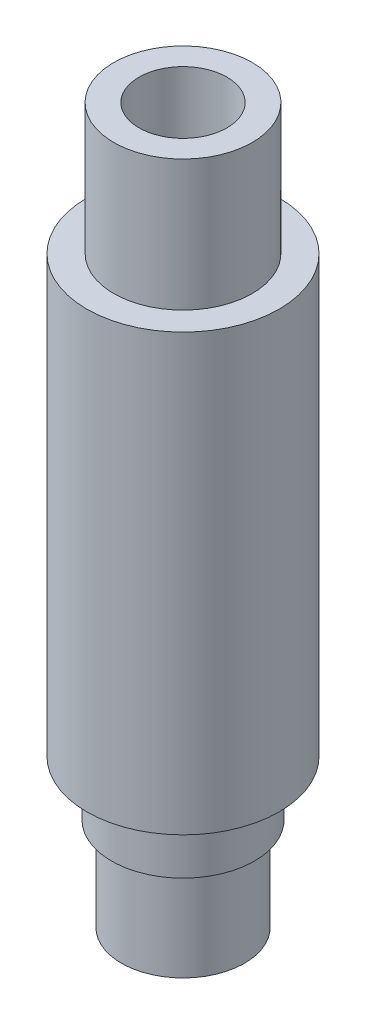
ISO-10303-21;
HEADER;
FILE_DESCRIPTION(('STEP AP214'),'2;1');
FILE_NAME('part.step','',(''),(''),'','','');
FILE_SCHEMA(('AUTOMOTIVE_DESIGN { 1 0 10303 214 1 1 1 1 }'));
ENDSEC;
DATA;
#1=APPLICATION_CONTEXT('core data for automotive mechanical design processes');
#2=APPLICATION_PROTOCOL_DEFINITION('international standard','automotive_design',2000,#1);
#3=PRODUCT_CONTEXT('',#1,'mechanical');
#4=PRODUCT('Part','Part','',(#3));
#5=PRODUCT_RELATED_PRODUCT_CATEGORY('part','',(#4));
#6=PRODUCT_DEFINITION_FORMATION('','',#4);
#7=PRODUCT_DEFINITION_CONTEXT('part definition',#1,'design');
#8=PRODUCT_DEFINITION('design','',#6,#7);
#9=PRODUCT_DEFINITION_SHAPE('','',#8);
#10=(LENGTH_UNIT() NAMED_UNIT(*) SI_UNIT(.MILLI.,.METRE.));
#11=(NAMED_UNIT(*) PLANE_ANGLE_UNIT() SI_UNIT($,.RADIAN.));
#12=(NAMED_UNIT(*) SI_UNIT($,.STERADIAN.) SOLID_ANGLE_UNIT());
#13=UNCERTAINTY_MEASURE_WITH_UNIT(LENGTH_MEASURE(1.E-05),#10,'distance_accuracy_value','');
#14=(GEOMETRIC_REPRESENTATION_CONTEXT(3) GLOBAL_UNCERTAINTY_ASSIGNED_CONTEXT((#13)) GLOBAL_UNIT_ASSIGNED_CONTEXT((#10,
#11,#12)) REPRESENTATION_CONTEXT('',''));
#15=CARTESIAN_POINT('',(0.,0.,0.));
#16=DIRECTION('',(0.,0.,1.));
#17=DIRECTION('',(1.,0.,0.));
#18=AXIS2_PLACEMENT_3D('',#15,#16,#17);
#19=CARTESIAN_POINT('',(0.,-5.95,0.));
#20=DIRECTION('',(0.,1.,0.));
#21=DIRECTION('',(0.,0.,1.));
#22=AXIS2_PLACEMENT_3D('',#19,#20,#21);
#23=CYLINDRICAL_SURFACE('',#22,2.);
#24=CARTESIAN_POINT('',(0.,0.,0.));
#25=DIRECTION('',(0.,-1.,0.));
#26=DIRECTION('',(0.,0.,-1.));
#27=AXIS2_PLACEMENT_3D('',#24,#25,#26);
#28=CIRCLE('',#27,2.);
#29=CARTESIAN_POINT('',(0.,0.,-2.));
#30=VERTEX_POINT('',#29);
#31=EDGE_CURVE('E10',#30,#30,#28,.T.);
#32=ORIENTED_EDGE('',*,*,#31,.F.);
#33=EDGE_LOOP('',(#32));
#34=FACE_BOUND('',#33,.T.);
#35=CARTESIAN_POINT('',(0.,-25.75,0.));
#36=DIRECTION('',(0.,-1.,0.));
#37=DIRECTION('',(0.,0.,-1.));
#38=AXIS2_PLACEMENT_3D('',#35,#36,#37);
#39=CIRCLE('',#38,2.);
#40=CARTESIAN_POINT('',(0.,-25.75,-2.));
#41=VERTEX_POINT('',#40);
#42=EDGE_CURVE('E23',#41,#41,#39,.T.);
#43=ORIENTED_EDGE('',*,*,#42,.T.);
#44=EDGE_LOOP('',(#43));
#45=FACE_BOUND('',#44,.T.);
#46=ADVANCED_FACE('F17',(#34,#45),#23,.F.);
#47=CARTESIAN_POINT('',(0.,-5.95,0.));
#48=DIRECTION('',(0.,1.,0.));
#49=DIRECTION('',(0.,0.,1.));
#50=AXIS2_PLACEMENT_3D('',#47,#48,#49);
#51=CYLINDRICAL_SURFACE('',#50,3.15);
#52=CARTESIAN_POINT('',(0.,-5.95,0.));
#53=DIRECTION('',(0.,-1.,0.));
#54=DIRECTION('',(0.,0.,-1.));
#55=AXIS2_PLACEMENT_3D('',#52,#53,#54);
#56=CIRCLE('',#55,3.15);
#57=CARTESIAN_POINT('',(0.,-5.95,-3.15));
#58=VERTEX_POINT('',#57);
#59=EDGE_CURVE('E27',#58,#58,#56,.T.);
#60=ORIENTED_EDGE('',*,*,#59,.F.);
#61=EDGE_LOOP('',(#60));
#62=FACE_BOUND('',#61,.T.);
#63=CARTESIAN_POINT('',(0.,0.,0.));
#64=DIRECTION('',(0.,-1.,0.));
#65=DIRECTION('',(0.,0.,-1.));
#66=AXIS2_PLACEMENT_3D('',#63,#64,#65);
#67=CIRCLE('',#66,3.15);
#68=CARTESIAN_POINT('',(0.,0.,-3.15));
#69=VERTEX_POINT('',#68);
#70=EDGE_CURVE('E31',#69,#69,#67,.T.);
#71=ORIENTED_EDGE('',*,*,#70,.T.);
#72=EDGE_LOOP('',(#71));
#73=FACE_BOUND('',#72,.T.);
#74=ADVANCED_FACE('F104',(#62,#73),#51,.T.);
#75=CARTESIAN_POINT('',(0.,0.,0.));
#76=DIRECTION('',(0.,-1.,0.));
#77=DIRECTION('',(1.,0.,0.));
#78=AXIS2_PLACEMENT_3D('',#75,#76,#77);
#79=PLANE('',#78);
#80=ORIENTED_EDGE('',*,*,#31,.T.);
#81=EDGE_LOOP('',(#80));
#82=FACE_BOUND('',#81,.T.);
#83=ORIENTED_EDGE('',*,*,#70,.F.);
#84=EDGE_LOOP('',(#83));
#85=FACE_BOUND('',#84,.T.);
#86=ADVANCED_FACE('F93',(#82,#85),#79,.F.);
#87=CARTESIAN_POINT('',(0.,-25.75,0.));
#88=DIRECTION('',(0.,1.,0.));
#89=DIRECTION('',(0.,0.,1.));
#90=AXIS2_PLACEMENT_3D('',#87,#88,#89);
#91=CYLINDRICAL_SURFACE('',#90,4.375);
#92=CARTESIAN_POINT('',(0.,-25.75,0.));
#93=DIRECTION('',(0.,-1.,0.));
#94=DIRECTION('',(0.,0.,-1.));
#95=AXIS2_PLACEMENT_3D('',#92,#93,#94);
#96=CIRCLE('',#95,4.375);
#97=CARTESIAN_POINT('',(0.,-25.75,-4.375));
#98=VERTEX_POINT('',#97);
#99=EDGE_CURVE('E36',#98,#98,#96,.T.);
#100=ORIENTED_EDGE('',*,*,#99,.F.);
#101=EDGE_LOOP('',(#100));
#102=FACE_BOUND('',#101,.T.);
#103=CARTESIAN_POINT('',(0.,-5.95,0.));
#104=DIRECTION('',(0.,-1.,0.));
#105=DIRECTION('',(0.,0.,-1.));
#106=AXIS2_PLACEMENT_3D('',#103,#104,#105);
#107=CIRCLE('',#106,4.375);
#108=CARTESIAN_POINT('',(0.,-5.95,-4.375));
#109=VERTEX_POINT('',#108);
#110=EDGE_CURVE('E39',#109,#109,#107,.T.);
#111=ORIENTED_EDGE('',*,*,#110,.T.);
#112=EDGE_LOOP('',(#111));
#113=FACE_BOUND('',#112,.T.);
#114=ADVANCED_FACE('F87',(#102,#113),#91,.T.);
#115=CARTESIAN_POINT('',(0.,-25.75,0.));
#116=DIRECTION('',(0.,-1.,0.));
#117=DIRECTION('',(1.,0.,0.));
#118=AXIS2_PLACEMENT_3D('',#115,#116,#117);
#119=PLANE('',#118);
#120=CARTESIAN_POINT('',(0.,-25.75,0.));
#121=DIRECTION('',(0.,-1.,0.));
#122=DIRECTION('',(0.,0.,-1.));
#123=AXIS2_PLACEMENT_3D('',#120,#121,#122);
#124=CIRCLE('',#123,3.25);
#125=CARTESIAN_POINT('',(0.,-25.75,-3.25));
#126=VERTEX_POINT('',#125);
#127=EDGE_CURVE('E42',#126,#126,#124,.T.);
#128=ORIENTED_EDGE('',*,*,#127,.F.);
#129=EDGE_LOOP('',(#128));
#130=FACE_BOUND('',#129,.T.);
#131=ORIENTED_EDGE('',*,*,#99,.T.);
#132=EDGE_LOOP('',(#131));
#133=FACE_BOUND('',#132,.T.);
#134=ADVANCED_FACE('F84',(#130,#133),#119,.T.);
#135=CARTESIAN_POINT('',(0.,-5.95,0.));
#136=DIRECTION('',(0.,-1.,0.));
#137=DIRECTION('',(1.,0.,0.));
#138=AXIS2_PLACEMENT_3D('',#135,#136,#137);
#139=PLANE('',#138);
#140=ORIENTED_EDGE('',*,*,#59,.T.);
#141=EDGE_LOOP('',(#140));
#142=FACE_BOUND('',#141,.T.);
#143=ORIENTED_EDGE('',*,*,#110,.F.);
#144=EDGE_LOOP('',(#143));
#145=FACE_BOUND('',#144,.T.);
#146=ADVANCED_FACE('F80',(#142,#145),#139,.F.);
#147=CARTESIAN_POINT('',(0.,-28.25,0.));
#148=DIRECTION('',(0.,1.,0.));
#149=DIRECTION('',(0.,0.,1.));
#150=AXIS2_PLACEMENT_3D('',#147,#148,#149);
#151=CYLINDRICAL_SURFACE('',#150,3.25);
#152=CARTESIAN_POINT('',(0.,-28.25,0.));
#153=DIRECTION('',(0.,-1.,0.));
#154=DIRECTION('',(0.,0.,-1.));
#155=AXIS2_PLACEMENT_3D('',#152,#153,#154);
#156=CIRCLE('',#155,3.25);
#157=CARTESIAN_POINT('',(0.,-28.25,-3.25));
#158=VERTEX_POINT('',#157);
#159=EDGE_CURVE('E45',#158,#158,#156,.T.);
#160=ORIENTED_EDGE('',*,*,#159,.F.);
#161=EDGE_LOOP('',(#160));
#162=FACE_BOUND('',#161,.T.);
#163=ORIENTED_EDGE('',*,*,#127,.T.);
#164=EDGE_LOOP('',(#163));
#165=FACE_BOUND('',#164,.T.);
#166=ADVANCED_FACE('F77',(#162,#165),#151,.T.);
#167=CARTESIAN_POINT('',(0.,-28.25,0.));
#168=DIRECTION('',(0.,1.,0.));
#169=DIRECTION('',(0.,0.,1.));
#170=AXIS2_PLACEMENT_3D('',#167,#168,#169);
#171=CYLINDRICAL_SURFACE('',#170,1.5);
#172=CARTESIAN_POINT('',(0.,-25.75,0.));
#173=DIRECTION('',(0.,-1.,0.));
#174=DIRECTION('',(0.,0.,-1.));
#175=AXIS2_PLACEMENT_3D('',#172,#173,#174);
#176=CIRCLE('',#175,1.5);
#177=CARTESIAN_POINT('',(0.,-25.75,-1.5));
#178=VERTEX_POINT('',#177);
#179=EDGE_CURVE('E48',#178,#178,#176,.T.);
#180=ORIENTED_EDGE('',*,*,#179,.F.);
#181=EDGE_LOOP('',(#180));
#182=FACE_BOUND('',#181,.T.);
#183=CARTESIAN_POINT('',(0.,-32.5,0.));
#184=DIRECTION('',(0.,-1.,0.));
#185=DIRECTION('',(0.,0.,-1.));
#186=AXIS2_PLACEMENT_3D('',#183,#184,#185);
#187=CIRCLE('',#186,1.5);
#188=CARTESIAN_POINT('',(0.,-32.5,-1.5));
#189=VERTEX_POINT('',#188);
#190=EDGE_CURVE('E51',#189,#189,#187,.T.);
#191=ORIENTED_EDGE('',*,*,#190,.T.);
#192=EDGE_LOOP('',(#191));
#193=FACE_BOUND('',#192,.T.);
#194=ADVANCED_FACE('F73',(#182,#193),#171,.F.);
#195=CARTESIAN_POINT('',(0.,-28.25,0.));
#196=DIRECTION('',(0.,-1.,0.));
#197=DIRECTION('',(1.,0.,0.));
#198=AXIS2_PLACEMENT_3D('',#195,#196,#197);
#199=PLANE('',#198);
#200=CARTESIAN_POINT('',(0.,-28.25,0.));
#201=DIRECTION('',(0.,-1.,0.));
#202=DIRECTION('',(0.,0.,-1.));
#203=AXIS2_PLACEMENT_3D('',#200,#201,#202);
#204=CIRCLE('',#203,2.8);
#205=CARTESIAN_POINT('',(0.,-28.25,-2.8));
#206=VERTEX_POINT('',#205);
#207=EDGE_CURVE('E54',#206,#206,#204,.T.);
#208=ORIENTED_EDGE('',*,*,#207,.F.);
#209=EDGE_LOOP('',(#208));
#210=FACE_BOUND('',#209,.T.);
#211=ORIENTED_EDGE('',*,*,#159,.T.);
#212=EDGE_LOOP('',(#211));
#213=FACE_BOUND('',#212,.T.);
#214=ADVANCED_FACE('F70',(#210,#213),#199,.T.);
#215=CARTESIAN_POINT('',(0.,-25.75,0.));
#216=DIRECTION('',(0.,-1.,0.));
#217=DIRECTION('',(1.,0.,0.));
#218=AXIS2_PLACEMENT_3D('',#215,#216,#217);
#219=PLANE('',#218);
#220=ORIENTED_EDGE('',*,*,#42,.F.);
#221=EDGE_LOOP('',(#220));
#222=FACE_BOUND('',#221,.T.);
#223=ORIENTED_EDGE('',*,*,#179,.T.);
#224=EDGE_LOOP('',(#223));
#225=FACE_BOUND('',#224,.T.);
#226=ADVANCED_FACE('F66',(#222,#225),#219,.F.);
#227=CARTESIAN_POINT('',(0.,-32.5,0.));
#228=DIRECTION('',(0.,1.,0.));
#229=DIRECTION('',(0.,0.,1.));
#230=AXIS2_PLACEMENT_3D('',#227,#228,#229);
#231=CYLINDRICAL_SURFACE('',#230,2.8);
#232=CARTESIAN_POINT('',(0.,-32.5,0.));
#233=DIRECTION('',(0.,-1.,0.));
#234=DIRECTION('',(0.,0.,-1.));
#235=AXIS2_PLACEMENT_3D('',#232,#233,#234);
#236=CIRCLE('',#235,2.8);
#237=CARTESIAN_POINT('',(0.,-32.5,-2.8));
#238=VERTEX_POINT('',#237);
#239=EDGE_CURVE('E57',#238,#238,#236,.T.);
#240=ORIENTED_EDGE('',*,*,#239,.F.);
#241=EDGE_LOOP('',(#240));
#242=FACE_BOUND('',#241,.T.);
#243=ORIENTED_EDGE('',*,*,#207,.T.);
#244=EDGE_LOOP('',(#243));
#245=FACE_BOUND('',#244,.T.);
#246=ADVANCED_FACE('F63',(#242,#245),#231,.T.);
#247=CARTESIAN_POINT('',(0.,-32.5,0.));
#248=DIRECTION('',(0.,-1.,0.));
#249=DIRECTION('',(1.,0.,0.));
#250=AXIS2_PLACEMENT_3D('',#247,#248,#249);
#251=PLANE('',#250);
#252=ORIENTED_EDGE('',*,*,#190,.F.);
#253=EDGE_LOOP('',(#252));
#254=FACE_BOUND('',#253,.T.);
#255=ORIENTED_EDGE('',*,*,#239,.T.);
#256=EDGE_LOOP('',(#255));
#257=FACE_BOUND('',#256,.T.);
#258=ADVANCED_FACE('F61',(#254,#257),#251,.T.);
#259=CLOSED_SHELL('',(#46,#74,#86,#114,#134,#146,#166,#194,#214,#226,#246,#258));
#260=MANIFOLD_SOLID_BREP('B1',#259);
#261=ADVANCED_BREP_SHAPE_REPRESENTATION('',(#18,#260),#14);
#262=SHAPE_DEFINITION_REPRESENTATION(#9,#261);
ENDSEC;
END-ISO-10303-21;
